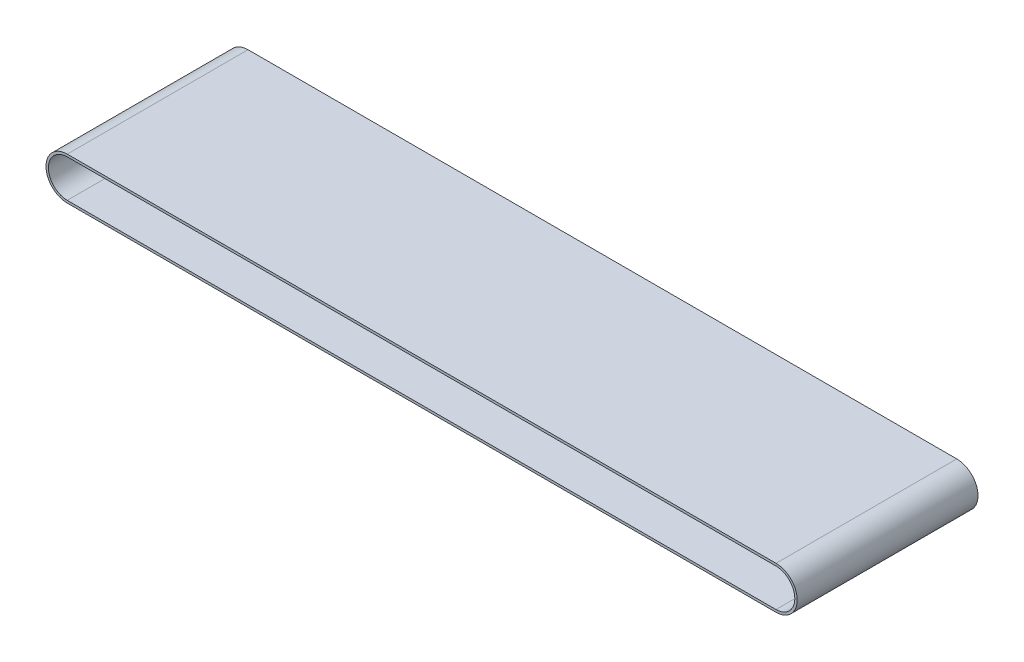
from build123d import *

# Parameters (mm, degrees)
BOSS_EXTRUDE1_DEPTH = 60


with BuildPart() as part:
    # Sketch1 → Boss-Extrude1 (new, symmetric)
    with BuildSketch(Plane.XY):
        with BuildLine():
            Line((-486.0125, 35), (-15.575, 35))
            ThreePointArc((-15.575, 35), (-1.4875, 20.9125), (-15.575, 6.825))
            Line((-15.575, 6.825), (-486.0125, 6.825))
            ThreePointArc((-486.0125, 6.825), (-500.1, 20.9125), (-486.0125, 35))
        make_face()
        with BuildLine():
            ThreePointArc((-15.575, 8.4125), (-3.075, 20.9125), (-15.575, 33.4125))
            Line((-15.575, 33.4125), (-486.0125, 33.4125))
            ThreePointArc((-486.0125, 33.4125), (-498.5125, 20.9125), (-486.0125, 8.4125))
            Line((-486.0125, 8.4125), (-15.575, 8.4125))
        make_face(mode=Mode.SUBTRACT)
    extrude(amount=BOSS_EXTRUDE1_DEPTH, both=True)


solid = part.part
